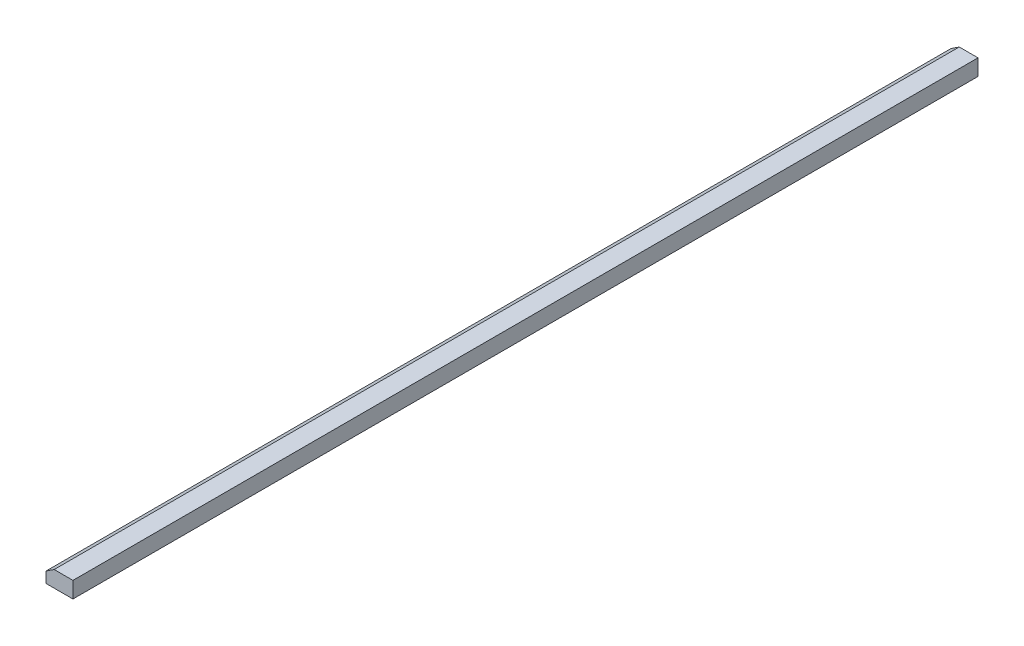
ISO-10303-21;
HEADER;
FILE_DESCRIPTION(('STEP AP214'),'2;1');
FILE_NAME('part.step','',(''),(''),'','','');
FILE_SCHEMA(('AUTOMOTIVE_DESIGN { 1 0 10303 214 1 1 1 1 }'));
ENDSEC;
DATA;
#1=APPLICATION_CONTEXT('core data for automotive mechanical design processes');
#2=APPLICATION_PROTOCOL_DEFINITION('international standard','automotive_design',2000,#1);
#3=PRODUCT_CONTEXT('',#1,'mechanical');
#4=PRODUCT('Part','Part','',(#3));
#5=PRODUCT_RELATED_PRODUCT_CATEGORY('part','',(#4));
#6=PRODUCT_DEFINITION_FORMATION('','',#4);
#7=PRODUCT_DEFINITION_CONTEXT('part definition',#1,'design');
#8=PRODUCT_DEFINITION('design','',#6,#7);
#9=PRODUCT_DEFINITION_SHAPE('','',#8);
#10=(LENGTH_UNIT() NAMED_UNIT(*) SI_UNIT(.MILLI.,.METRE.));
#11=(NAMED_UNIT(*) PLANE_ANGLE_UNIT() SI_UNIT($,.RADIAN.));
#12=(NAMED_UNIT(*) SI_UNIT($,.STERADIAN.) SOLID_ANGLE_UNIT());
#13=UNCERTAINTY_MEASURE_WITH_UNIT(LENGTH_MEASURE(1.E-05),#10,'distance_accuracy_value','');
#14=(GEOMETRIC_REPRESENTATION_CONTEXT(3) GLOBAL_UNCERTAINTY_ASSIGNED_CONTEXT((#13)) GLOBAL_UNIT_ASSIGNED_CONTEXT((#10,
#11,#12)) REPRESENTATION_CONTEXT('',''));
#15=CARTESIAN_POINT('',(0.,0.,0.));
#16=DIRECTION('',(0.,0.,1.));
#17=DIRECTION('',(1.,0.,0.));
#18=AXIS2_PLACEMENT_3D('',#15,#16,#17);
#19=CARTESIAN_POINT('',(0.,3.42187948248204,840.));
#20=DIRECTION('',(1.,0.,0.));
#21=DIRECTION('',(0.,1.,0.));
#22=AXIS2_PLACEMENT_3D('',#19,#20,#21);
#23=PLANE('',#22);
#24=DIRECTION('',(0.,-1.,0.));
#25=VECTOR('',#24,1.);
#26=CARTESIAN_POINT('',(0.,3.42187948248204,0.));
#27=LINE('',#26,#25);
#28=CARTESIAN_POINT('',(0.,13.4171881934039,0.));
#29=VERTEX_POINT('',#28);
#30=CARTESIAN_POINT('',(0.,3.42187948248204,0.));
#31=VERTEX_POINT('',#30);
#32=EDGE_CURVE('E76',#29,#31,#27,.T.);
#33=ORIENTED_EDGE('',*,*,#32,.T.);
#34=DIRECTION('',(0.,0.,-1.));
#35=VECTOR('',#34,1.);
#36=CARTESIAN_POINT('',(0.,3.42187948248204,840.));
#37=LINE('',#36,#35);
#38=CARTESIAN_POINT('',(0.,3.42187948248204,840.));
#39=VERTEX_POINT('',#38);
#40=EDGE_CURVE('E11',#39,#31,#37,.T.);
#41=ORIENTED_EDGE('',*,*,#40,.F.);
#42=DIRECTION('',(0.,-1.,0.));
#43=VECTOR('',#42,1.);
#44=CARTESIAN_POINT('',(0.,3.42187948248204,840.));
#45=LINE('',#44,#43);
#46=CARTESIAN_POINT('',(0.,13.4171881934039,840.));
#47=VERTEX_POINT('',#46);
#48=EDGE_CURVE('E97',#47,#39,#45,.T.);
#49=ORIENTED_EDGE('',*,*,#48,.F.);
#50=DIRECTION('',(0.,0.,-1.));
#51=VECTOR('',#50,1.);
#52=CARTESIAN_POINT('',(0.,13.4171881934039,840.));
#53=LINE('',#52,#51);
#54=EDGE_CURVE('E89',#47,#29,#53,.T.);
#55=ORIENTED_EDGE('',*,*,#54,.T.);
#56=EDGE_LOOP('',(#33,#41,#49,#55));
#57=FACE_BOUND('',#56,.T.);
#58=ADVANCED_FACE('F26',(#57),#23,.F.);
#59=CARTESIAN_POINT('',(0.,3.42187948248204,840.));
#60=DIRECTION('',(0.,1.,0.));
#61=DIRECTION('',(-1.,0.,0.));
#62=AXIS2_PLACEMENT_3D('',#59,#60,#61);
#63=PLANE('',#62);
#64=DIRECTION('',(1.,0.,0.));
#65=VECTOR('',#64,1.);
#66=CARTESIAN_POINT('',(0.,3.42187948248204,0.));
#67=LINE('',#66,#65);
#68=CARTESIAN_POINT('',(25.,3.42187948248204,0.));
#69=VERTEX_POINT('',#68);
#70=EDGE_CURVE('E72',#31,#69,#67,.T.);
#71=ORIENTED_EDGE('',*,*,#70,.T.);
#72=DIRECTION('',(0.,0.,-1.));
#73=VECTOR('',#72,1.);
#74=CARTESIAN_POINT('',(25.,3.42187948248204,840.));
#75=LINE('',#74,#73);
#76=CARTESIAN_POINT('',(25.,3.42187948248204,840.));
#77=VERTEX_POINT('',#76);
#78=EDGE_CURVE('E33',#77,#69,#75,.T.);
#79=ORIENTED_EDGE('',*,*,#78,.F.);
#80=DIRECTION('',(1.,0.,0.));
#81=VECTOR('',#80,1.);
#82=CARTESIAN_POINT('',(0.,3.42187948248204,840.));
#83=LINE('',#82,#81);
#84=EDGE_CURVE('E85',#39,#77,#83,.T.);
#85=ORIENTED_EDGE('',*,*,#84,.F.);
#86=ORIENTED_EDGE('',*,*,#40,.T.);
#87=EDGE_LOOP('',(#71,#79,#85,#86));
#88=FACE_BOUND('',#87,.T.);
#89=ADVANCED_FACE('F84',(#88),#63,.F.);
#90=CARTESIAN_POINT('',(25.,3.42187948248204,840.));
#91=DIRECTION('',(-1.,0.,0.));
#92=DIRECTION('',(0.,0.,1.));
#93=AXIS2_PLACEMENT_3D('',#90,#91,#92);
#94=PLANE('',#93);
#95=DIRECTION('',(0.,1.,0.));
#96=VECTOR('',#95,1.);
#97=CARTESIAN_POINT('',(25.,3.42187948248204,0.));
#98=LINE('',#97,#96);
#99=CARTESIAN_POINT('',(25.,18.421879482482,0.));
#100=VERTEX_POINT('',#99);
#101=EDGE_CURVE('E78',#69,#100,#98,.T.);
#102=ORIENTED_EDGE('',*,*,#101,.T.);
#103=DIRECTION('',(0.,0.,-1.));
#104=VECTOR('',#103,1.);
#105=CARTESIAN_POINT('',(25.,18.421879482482,840.));
#106=LINE('',#105,#104);
#107=CARTESIAN_POINT('',(25.,18.421879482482,840.));
#108=VERTEX_POINT('',#107);
#109=EDGE_CURVE('E108',#108,#100,#106,.T.);
#110=ORIENTED_EDGE('',*,*,#109,.F.);
#111=DIRECTION('',(0.,1.,0.));
#112=VECTOR('',#111,1.);
#113=CARTESIAN_POINT('',(25.,3.42187948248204,840.));
#114=LINE('',#113,#112);
#115=EDGE_CURVE('E100',#77,#108,#114,.T.);
#116=ORIENTED_EDGE('',*,*,#115,.F.);
#117=ORIENTED_EDGE('',*,*,#78,.T.);
#118=EDGE_LOOP('',(#102,#110,#116,#117));
#119=FACE_BOUND('',#118,.T.);
#120=ADVANCED_FACE('F112',(#119),#94,.F.);
#121=CARTESIAN_POINT('',(25.,18.421879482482,840.));
#122=DIRECTION('',(0.,-1.,0.));
#123=DIRECTION('',(0.,0.,-1.));
#124=AXIS2_PLACEMENT_3D('',#121,#122,#123);
#125=PLANE('',#124);
#126=DIRECTION('',(-1.,0.,0.));
#127=VECTOR('',#126,1.);
#128=CARTESIAN_POINT('',(25.,18.421879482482,0.));
#129=LINE('',#128,#127);
#130=CARTESIAN_POINT('',(7.56523101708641,18.421879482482,0.));
#131=VERTEX_POINT('',#130);
#132=EDGE_CURVE('E93',#100,#131,#129,.T.);
#133=ORIENTED_EDGE('',*,*,#132,.T.);
#134=DIRECTION('',(0.,0.,-1.));
#135=VECTOR('',#134,1.);
#136=CARTESIAN_POINT('',(7.56523101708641,18.421879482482,840.));
#137=LINE('',#136,#135);
#138=CARTESIAN_POINT('',(7.56523101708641,18.421879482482,840.));
#139=VERTEX_POINT('',#138);
#140=EDGE_CURVE('E105',#139,#131,#137,.T.);
#141=ORIENTED_EDGE('',*,*,#140,.F.);
#142=DIRECTION('',(-1.,0.,0.));
#143=VECTOR('',#142,1.);
#144=CARTESIAN_POINT('',(25.,18.421879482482,840.));
#145=LINE('',#144,#143);
#146=EDGE_CURVE('E45',#108,#139,#145,.T.);
#147=ORIENTED_EDGE('',*,*,#146,.F.);
#148=ORIENTED_EDGE('',*,*,#109,.T.);
#149=EDGE_LOOP('',(#133,#141,#147,#148));
#150=FACE_BOUND('',#149,.T.);
#151=ADVANCED_FACE('F123',(#150),#125,.F.);
#152=CARTESIAN_POINT('',(0.,13.4171881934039,840.));
#153=DIRECTION('',(0.551735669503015,-0.834019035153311,0.));
#154=DIRECTION('',(0.834019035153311,0.551735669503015,0.));
#155=AXIS2_PLACEMENT_3D('',#152,#153,#154);
#156=PLANE('',#155);
#157=DIRECTION('',(-0.834019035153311,-0.551735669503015,0.));
#158=VECTOR('',#157,1.);
#159=CARTESIAN_POINT('',(0.,13.4171881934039,0.));
#160=LINE('',#159,#158);
#161=EDGE_CURVE('E95',#131,#29,#160,.T.);
#162=ORIENTED_EDGE('',*,*,#161,.T.);
#163=ORIENTED_EDGE('',*,*,#54,.F.);
#164=DIRECTION('',(-0.834019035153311,-0.551735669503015,0.));
#165=VECTOR('',#164,1.);
#166=CARTESIAN_POINT('',(0.,13.4171881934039,840.));
#167=LINE('',#166,#165);
#168=EDGE_CURVE('E40',#139,#47,#167,.T.);
#169=ORIENTED_EDGE('',*,*,#168,.F.);
#170=ORIENTED_EDGE('',*,*,#140,.T.);
#171=EDGE_LOOP('',(#162,#163,#169,#170));
#172=FACE_BOUND('',#171,.T.);
#173=ADVANCED_FACE('F116',(#172),#156,.F.);
#174=CARTESIAN_POINT('',(0.,18.421879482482,840.));
#175=DIRECTION('',(0.,0.,1.));
#176=DIRECTION('',(1.,0.,0.));
#177=AXIS2_PLACEMENT_3D('',#174,#175,#176);
#178=PLANE('',#177);
#179=ORIENTED_EDGE('',*,*,#48,.T.);
#180=ORIENTED_EDGE('',*,*,#84,.T.);
#181=ORIENTED_EDGE('',*,*,#115,.T.);
#182=ORIENTED_EDGE('',*,*,#146,.T.);
#183=ORIENTED_EDGE('',*,*,#168,.T.);
#184=EDGE_LOOP('',(#179,#180,#181,#182,#183));
#185=FACE_BOUND('',#184,.T.);
#186=ADVANCED_FACE('F114',(#185),#178,.T.);
#187=CARTESIAN_POINT('',(0.,18.421879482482,0.));
#188=DIRECTION('',(0.,0.,1.));
#189=DIRECTION('',(1.,0.,0.));
#190=AXIS2_PLACEMENT_3D('',#187,#188,#189);
#191=PLANE('',#190);
#192=ORIENTED_EDGE('',*,*,#32,.F.);
#193=ORIENTED_EDGE('',*,*,#161,.F.);
#194=ORIENTED_EDGE('',*,*,#132,.F.);
#195=ORIENTED_EDGE('',*,*,#101,.F.);
#196=ORIENTED_EDGE('',*,*,#70,.F.);
#197=EDGE_LOOP('',(#192,#193,#194,#195,#196));
#198=FACE_BOUND('',#197,.T.);
#199=ADVANCED_FACE('F73',(#198),#191,.F.);
#200=CLOSED_SHELL('',(#58,#89,#120,#151,#173,#186,#199));
#201=MANIFOLD_SOLID_BREP('B2',#200);
#202=ADVANCED_BREP_SHAPE_REPRESENTATION('',(#18,#201),#14);
#203=SHAPE_DEFINITION_REPRESENTATION(#9,#202);
ENDSEC;
END-ISO-10303-21;
